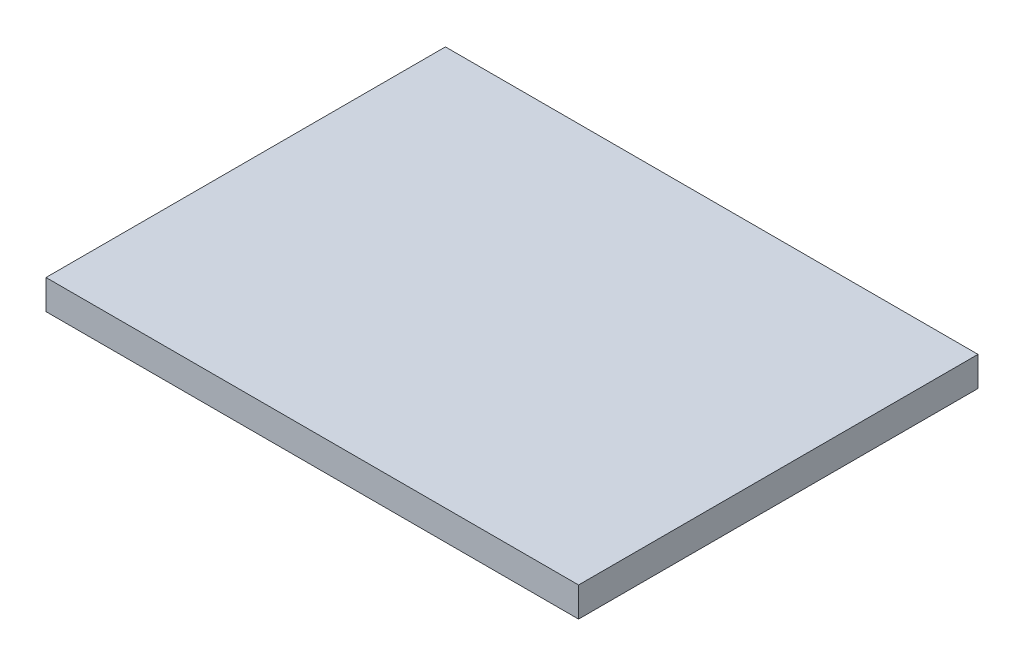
ISO-10303-21;
HEADER;
FILE_DESCRIPTION(('STEP AP214'),'2;1');
FILE_NAME('part.step','',(''),(''),'','','');
FILE_SCHEMA(('AUTOMOTIVE_DESIGN { 1 0 10303 214 1 1 1 1 }'));
ENDSEC;
DATA;
#1=APPLICATION_CONTEXT('core data for automotive mechanical design processes');
#2=APPLICATION_PROTOCOL_DEFINITION('international standard','automotive_design',2000,#1);
#3=PRODUCT_CONTEXT('',#1,'mechanical');
#4=PRODUCT('Part','Part','',(#3));
#5=PRODUCT_RELATED_PRODUCT_CATEGORY('part','',(#4));
#6=PRODUCT_DEFINITION_FORMATION('','',#4);
#7=PRODUCT_DEFINITION_CONTEXT('part definition',#1,'design');
#8=PRODUCT_DEFINITION('design','',#6,#7);
#9=PRODUCT_DEFINITION_SHAPE('','',#8);
#10=(LENGTH_UNIT() NAMED_UNIT(*) SI_UNIT(.MILLI.,.METRE.));
#11=(NAMED_UNIT(*) PLANE_ANGLE_UNIT() SI_UNIT($,.RADIAN.));
#12=(NAMED_UNIT(*) SI_UNIT($,.STERADIAN.) SOLID_ANGLE_UNIT());
#13=UNCERTAINTY_MEASURE_WITH_UNIT(LENGTH_MEASURE(1.E-05),#10,'distance_accuracy_value','');
#14=(GEOMETRIC_REPRESENTATION_CONTEXT(3) GLOBAL_UNCERTAINTY_ASSIGNED_CONTEXT((#13)) GLOBAL_UNIT_ASSIGNED_CONTEXT((#10,
#11,#12)) REPRESENTATION_CONTEXT('',''));
#15=CARTESIAN_POINT('',(0.,0.,0.));
#16=DIRECTION('',(0.,0.,1.));
#17=DIRECTION('',(1.,0.,0.));
#18=AXIS2_PLACEMENT_3D('',#15,#16,#17);
#19=CARTESIAN_POINT('',(-36.,-2.,0.));
#20=DIRECTION('',(0.,1.,0.));
#21=DIRECTION('',(0.,0.,1.));
#22=AXIS2_PLACEMENT_3D('',#19,#20,#21);
#23=PLANE('',#22);
#24=CARTESIAN_POINT('',(-5.5,-2.,21.5));
#25=DIRECTION('',(0.,-1.,0.));
#26=DIRECTION('',(-1.,0.,0.));
#27=AXIS2_PLACEMENT_3D('',#24,#25,#26);
#28=CIRCLE('',#27,2.5);
#29=CARTESIAN_POINT('',(-6.,-2.,19.0505102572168));
#30=VERTEX_POINT('',#29);
#31=CARTESIAN_POINT('',(-6.,-2.,23.9494897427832));
#32=VERTEX_POINT('',#31);
#33=EDGE_CURVE('E106',#30,#32,#28,.T.);
#34=ORIENTED_EDGE('',*,*,#33,.F.);
#35=DIRECTION('',(0.,0.,-1.));
#36=VECTOR('',#35,1.);
#37=CARTESIAN_POINT('',(-6.,-2.,23.9494897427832));
#38=LINE('',#37,#36);
#39=EDGE_CURVE('E47',#32,#30,#38,.T.);
#40=ORIENTED_EDGE('',*,*,#39,.F.);
#41=EDGE_LOOP('',(#34,#40));
#42=FACE_BOUND('',#41,.T.);
#43=DIRECTION('',(1.,0.,0.));
#44=VECTOR('',#43,1.);
#45=CARTESIAN_POINT('',(0.,-2.,0.));
#46=LINE('',#45,#44);
#47=CARTESIAN_POINT('',(-36.,-2.,0.));
#48=VERTEX_POINT('',#47);
#49=CARTESIAN_POINT('',(0.,-2.,0.));
#50=VERTEX_POINT('',#49);
#51=EDGE_CURVE('E133',#48,#50,#46,.T.);
#52=ORIENTED_EDGE('',*,*,#51,.T.);
#53=DIRECTION('',(0.,0.,1.));
#54=VECTOR('',#53,1.);
#55=CARTESIAN_POINT('',(0.,-2.,0.));
#56=LINE('',#55,#54);
#57=CARTESIAN_POINT('',(0.,-2.,27.));
#58=VERTEX_POINT('',#57);
#59=EDGE_CURVE('E136',#50,#58,#56,.T.);
#60=ORIENTED_EDGE('',*,*,#59,.T.);
#61=DIRECTION('',(-1.,0.,0.));
#62=VECTOR('',#61,1.);
#63=CARTESIAN_POINT('',(0.,-2.,27.));
#64=LINE('',#63,#62);
#65=CARTESIAN_POINT('',(-36.,-2.,27.));
#66=VERTEX_POINT('',#65);
#67=EDGE_CURVE('E138',#58,#66,#64,.T.);
#68=ORIENTED_EDGE('',*,*,#67,.T.);
#69=DIRECTION('',(0.,0.,-1.));
#70=VECTOR('',#69,1.);
#71=CARTESIAN_POINT('',(-36.,-2.,0.));
#72=LINE('',#71,#70);
#73=EDGE_CURVE('E140',#66,#48,#72,.T.);
#74=ORIENTED_EDGE('',*,*,#73,.T.);
#75=EDGE_LOOP('',(#52,#60,#68,#74));
#76=FACE_BOUND('',#75,.T.);
#77=CARTESIAN_POINT('',(-5.5,-2.,5.5));
#78=DIRECTION('',(0.,-1.,0.));
#79=DIRECTION('',(-1.,0.,0.));
#80=AXIS2_PLACEMENT_3D('',#77,#78,#79);
#81=CIRCLE('',#80,2.5);
#82=CARTESIAN_POINT('',(-6.,-2.,3.05051025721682));
#83=VERTEX_POINT('',#82);
#84=CARTESIAN_POINT('',(-6.,-2.,7.94948974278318));
#85=VERTEX_POINT('',#84);
#86=EDGE_CURVE('E89',#83,#85,#81,.T.);
#87=ORIENTED_EDGE('',*,*,#86,.F.);
#88=DIRECTION('',(0.,0.,-1.));
#89=VECTOR('',#88,1.);
#90=CARTESIAN_POINT('',(-6.,-2.,7.94948974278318));
#91=LINE('',#90,#89);
#92=EDGE_CURVE('E40',#85,#83,#91,.T.);
#93=ORIENTED_EDGE('',*,*,#92,.F.);
#94=EDGE_LOOP('',(#87,#93));
#95=FACE_BOUND('',#94,.T.);
#96=ADVANCED_FACE('F26',(#42,#76,#95),#23,.F.);
#97=CARTESIAN_POINT('',(0.,-2.,0.));
#98=DIRECTION('',(0.,0.,1.));
#99=DIRECTION('',(1.,0.,0.));
#100=AXIS2_PLACEMENT_3D('',#97,#98,#99);
#101=PLANE('',#100);
#102=DIRECTION('',(1.,0.,0.));
#103=VECTOR('',#102,1.);
#104=CARTESIAN_POINT('',(0.,0.,0.));
#105=LINE('',#104,#103);
#106=CARTESIAN_POINT('',(-36.,0.,0.));
#107=VERTEX_POINT('',#106);
#108=CARTESIAN_POINT('',(0.,0.,0.));
#109=VERTEX_POINT('',#108);
#110=EDGE_CURVE('E124',#107,#109,#105,.T.);
#111=ORIENTED_EDGE('',*,*,#110,.T.);
#112=DIRECTION('',(0.,1.,0.));
#113=VECTOR('',#112,1.);
#114=CARTESIAN_POINT('',(0.,-2.,0.));
#115=LINE('',#114,#113);
#116=EDGE_CURVE('E11',#50,#109,#115,.T.);
#117=ORIENTED_EDGE('',*,*,#116,.F.);
#118=ORIENTED_EDGE('',*,*,#51,.F.);
#119=DIRECTION('',(0.,1.,0.));
#120=VECTOR('',#119,1.);
#121=CARTESIAN_POINT('',(-36.,-2.,0.));
#122=LINE('',#121,#120);
#123=EDGE_CURVE('E142',#48,#107,#122,.T.);
#124=ORIENTED_EDGE('',*,*,#123,.T.);
#125=EDGE_LOOP('',(#111,#117,#118,#124));
#126=FACE_BOUND('',#125,.T.);
#127=ADVANCED_FACE('F28',(#126),#101,.F.);
#128=CARTESIAN_POINT('',(0.,-2.,0.));
#129=DIRECTION('',(-1.,0.,0.));
#130=DIRECTION('',(0.,0.,1.));
#131=AXIS2_PLACEMENT_3D('',#128,#129,#130);
#132=PLANE('',#131);
#133=DIRECTION('',(0.,0.,1.));
#134=VECTOR('',#133,1.);
#135=CARTESIAN_POINT('',(0.,0.,0.));
#136=LINE('',#135,#134);
#137=CARTESIAN_POINT('',(0.,0.,27.));
#138=VERTEX_POINT('',#137);
#139=EDGE_CURVE('E127',#109,#138,#136,.T.);
#140=ORIENTED_EDGE('',*,*,#139,.T.);
#141=DIRECTION('',(0.,1.,0.));
#142=VECTOR('',#141,1.);
#143=CARTESIAN_POINT('',(0.,-2.,27.));
#144=LINE('',#143,#142);
#145=EDGE_CURVE('E34',#58,#138,#144,.T.);
#146=ORIENTED_EDGE('',*,*,#145,.F.);
#147=ORIENTED_EDGE('',*,*,#59,.F.);
#148=ORIENTED_EDGE('',*,*,#116,.T.);
#149=EDGE_LOOP('',(#140,#146,#147,#148));
#150=FACE_BOUND('',#149,.T.);
#151=ADVANCED_FACE('F167',(#150),#132,.F.);
#152=CARTESIAN_POINT('',(0.,-2.,27.));
#153=DIRECTION('',(0.,0.,-1.));
#154=DIRECTION('',(-1.,0.,0.));
#155=AXIS2_PLACEMENT_3D('',#152,#153,#154);
#156=PLANE('',#155);
#157=DIRECTION('',(-1.,0.,0.));
#158=VECTOR('',#157,1.);
#159=CARTESIAN_POINT('',(0.,0.,27.));
#160=LINE('',#159,#158);
#161=CARTESIAN_POINT('',(-36.,0.,27.));
#162=VERTEX_POINT('',#161);
#163=EDGE_CURVE('E129',#138,#162,#160,.T.);
#164=ORIENTED_EDGE('',*,*,#163,.T.);
#165=DIRECTION('',(0.,1.,0.));
#166=VECTOR('',#165,1.);
#167=CARTESIAN_POINT('',(-36.,-2.,27.));
#168=LINE('',#167,#166);
#169=EDGE_CURVE('E145',#66,#162,#168,.T.);
#170=ORIENTED_EDGE('',*,*,#169,.F.);
#171=ORIENTED_EDGE('',*,*,#67,.F.);
#172=ORIENTED_EDGE('',*,*,#145,.T.);
#173=EDGE_LOOP('',(#164,#170,#171,#172));
#174=FACE_BOUND('',#173,.T.);
#175=ADVANCED_FACE('F152',(#174),#156,.F.);
#176=CARTESIAN_POINT('',(-36.,-2.,0.));
#177=DIRECTION('',(1.,0.,0.));
#178=DIRECTION('',(0.,0.,-1.));
#179=AXIS2_PLACEMENT_3D('',#176,#177,#178);
#180=PLANE('',#179);
#181=DIRECTION('',(0.,0.,-1.));
#182=VECTOR('',#181,1.);
#183=CARTESIAN_POINT('',(-36.,0.,0.));
#184=LINE('',#183,#182);
#185=EDGE_CURVE('E131',#162,#107,#184,.T.);
#186=ORIENTED_EDGE('',*,*,#185,.T.);
#187=ORIENTED_EDGE('',*,*,#123,.F.);
#188=ORIENTED_EDGE('',*,*,#73,.F.);
#189=ORIENTED_EDGE('',*,*,#169,.T.);
#190=EDGE_LOOP('',(#186,#187,#188,#189));
#191=FACE_BOUND('',#190,.T.);
#192=ADVANCED_FACE('F161',(#191),#180,.F.);
#193=CARTESIAN_POINT('',(-36.,0.,0.));
#194=DIRECTION('',(0.,1.,0.));
#195=DIRECTION('',(0.,0.,1.));
#196=AXIS2_PLACEMENT_3D('',#193,#194,#195);
#197=PLANE('',#196);
#198=ORIENTED_EDGE('',*,*,#110,.F.);
#199=ORIENTED_EDGE('',*,*,#185,.F.);
#200=ORIENTED_EDGE('',*,*,#163,.F.);
#201=ORIENTED_EDGE('',*,*,#139,.F.);
#202=EDGE_LOOP('',(#198,#199,#200,#201));
#203=FACE_BOUND('',#202,.T.);
#204=ADVANCED_FACE('F158',(#203),#197,.T.);
#205=CARTESIAN_POINT('',(-5.5,-5.,21.5));
#206=DIRECTION('',(0.,1.,0.));
#207=DIRECTION('',(-1.,0.,0.));
#208=AXIS2_PLACEMENT_3D('',#205,#206,#207);
#209=CYLINDRICAL_SURFACE('',#208,2.5);
#210=ORIENTED_EDGE('',*,*,#33,.T.);
#211=DIRECTION('',(0.,1.,0.));
#212=VECTOR('',#211,1.);
#213=CARTESIAN_POINT('',(-6.,-5.,23.9494897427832));
#214=LINE('',#213,#212);
#215=CARTESIAN_POINT('',(-6.,-5.,23.9494897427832));
#216=VERTEX_POINT('',#215);
#217=EDGE_CURVE('E122',#216,#32,#214,.T.);
#218=ORIENTED_EDGE('',*,*,#217,.F.);
#219=CARTESIAN_POINT('',(-5.5,-5.,21.5));
#220=DIRECTION('',(0.,-1.,0.));
#221=DIRECTION('',(-1.,0.,0.));
#222=AXIS2_PLACEMENT_3D('',#219,#220,#221);
#223=CIRCLE('',#222,2.5);
#224=CARTESIAN_POINT('',(-6.,-5.,19.0505102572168));
#225=VERTEX_POINT('',#224);
#226=EDGE_CURVE('E114',#225,#216,#223,.T.);
#227=ORIENTED_EDGE('',*,*,#226,.F.);
#228=DIRECTION('',(0.,1.,0.));
#229=VECTOR('',#228,1.);
#230=CARTESIAN_POINT('',(-6.,-5.,19.0505102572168));
#231=LINE('',#230,#229);
#232=EDGE_CURVE('E119',#225,#30,#231,.T.);
#233=ORIENTED_EDGE('',*,*,#232,.T.);
#234=EDGE_LOOP('',(#210,#218,#227,#233));
#235=FACE_BOUND('',#234,.T.);
#236=ADVANCED_FACE('F186',(#235),#209,.T.);
#237=CARTESIAN_POINT('',(-6.,-5.,23.9494897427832));
#238=DIRECTION('',(1.,0.,0.));
#239=DIRECTION('',(0.,1.,0.));
#240=AXIS2_PLACEMENT_3D('',#237,#238,#239);
#241=PLANE('',#240);
#242=ORIENTED_EDGE('',*,*,#39,.T.);
#243=ORIENTED_EDGE('',*,*,#232,.F.);
#244=DIRECTION('',(0.,0.,-1.));
#245=VECTOR('',#244,1.);
#246=CARTESIAN_POINT('',(-6.,-5.,23.9494897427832));
#247=LINE('',#246,#245);
#248=EDGE_CURVE('E117',#216,#225,#247,.T.);
#249=ORIENTED_EDGE('',*,*,#248,.F.);
#250=ORIENTED_EDGE('',*,*,#217,.T.);
#251=EDGE_LOOP('',(#242,#243,#249,#250));
#252=FACE_BOUND('',#251,.T.);
#253=ADVANCED_FACE('F189',(#252),#241,.F.);
#254=CARTESIAN_POINT('',(-5.5,-5.,21.5));
#255=DIRECTION('',(0.,1.,0.));
#256=DIRECTION('',(-1.,0.,0.));
#257=AXIS2_PLACEMENT_3D('',#254,#255,#256);
#258=PLANE('',#257);
#259=ORIENTED_EDGE('',*,*,#226,.T.);
#260=ORIENTED_EDGE('',*,*,#248,.T.);
#261=EDGE_LOOP('',(#259,#260));
#262=FACE_BOUND('',#261,.T.);
#263=ADVANCED_FACE('F194',(#262),#258,.F.);
#264=CARTESIAN_POINT('',(-5.5,-5.,5.5));
#265=DIRECTION('',(0.,1.,0.));
#266=DIRECTION('',(-1.,0.,0.));
#267=AXIS2_PLACEMENT_3D('',#264,#265,#266);
#268=CYLINDRICAL_SURFACE('',#267,2.5);
#269=ORIENTED_EDGE('',*,*,#86,.T.);
#270=DIRECTION('',(0.,1.,0.));
#271=VECTOR('',#270,1.);
#272=CARTESIAN_POINT('',(-6.,-5.,7.94948974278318));
#273=LINE('',#272,#271);
#274=CARTESIAN_POINT('',(-6.,-5.,7.94948974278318));
#275=VERTEX_POINT('',#274);
#276=EDGE_CURVE('E99',#275,#85,#273,.T.);
#277=ORIENTED_EDGE('',*,*,#276,.F.);
#278=CARTESIAN_POINT('',(-5.5,-5.,5.5));
#279=DIRECTION('',(0.,-1.,0.));
#280=DIRECTION('',(-1.,0.,0.));
#281=AXIS2_PLACEMENT_3D('',#278,#279,#280);
#282=CIRCLE('',#281,2.5);
#283=CARTESIAN_POINT('',(-6.,-5.,3.05051025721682));
#284=VERTEX_POINT('',#283);
#285=EDGE_CURVE('E100',#284,#275,#282,.T.);
#286=ORIENTED_EDGE('',*,*,#285,.F.);
#287=DIRECTION('',(0.,1.,0.));
#288=VECTOR('',#287,1.);
#289=CARTESIAN_POINT('',(-6.,-5.,3.05051025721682));
#290=LINE('',#289,#288);
#291=EDGE_CURVE('E97',#284,#83,#290,.T.);
#292=ORIENTED_EDGE('',*,*,#291,.T.);
#293=EDGE_LOOP('',(#269,#277,#286,#292));
#294=FACE_BOUND('',#293,.T.);
#295=ADVANCED_FACE('F102',(#294),#268,.T.);
#296=CARTESIAN_POINT('',(-6.,-5.,7.94948974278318));
#297=DIRECTION('',(1.,0.,0.));
#298=DIRECTION('',(0.,1.,0.));
#299=AXIS2_PLACEMENT_3D('',#296,#297,#298);
#300=PLANE('',#299);
#301=ORIENTED_EDGE('',*,*,#92,.T.);
#302=ORIENTED_EDGE('',*,*,#291,.F.);
#303=DIRECTION('',(0.,0.,-1.));
#304=VECTOR('',#303,1.);
#305=CARTESIAN_POINT('',(-6.,-5.,7.94948974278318));
#306=LINE('',#305,#304);
#307=EDGE_CURVE('E104',#275,#284,#306,.T.);
#308=ORIENTED_EDGE('',*,*,#307,.F.);
#309=ORIENTED_EDGE('',*,*,#276,.T.);
#310=EDGE_LOOP('',(#301,#302,#308,#309));
#311=FACE_BOUND('',#310,.T.);
#312=ADVANCED_FACE('F96',(#311),#300,.F.);
#313=CARTESIAN_POINT('',(-5.5,-5.,5.5));
#314=DIRECTION('',(0.,1.,0.));
#315=DIRECTION('',(-1.,0.,0.));
#316=AXIS2_PLACEMENT_3D('',#313,#314,#315);
#317=PLANE('',#316);
#318=ORIENTED_EDGE('',*,*,#285,.T.);
#319=ORIENTED_EDGE('',*,*,#307,.T.);
#320=EDGE_LOOP('',(#318,#319));
#321=FACE_BOUND('',#320,.T.);
#322=ADVANCED_FACE('F205',(#321),#317,.F.);
#323=CLOSED_SHELL('',(#96,#127,#151,#175,#192,#204,#236,#253,#263,#295,#312,#322));
#324=MANIFOLD_SOLID_BREP('B2',#323);
#325=ADVANCED_BREP_SHAPE_REPRESENTATION('',(#18,#324),#14);
#326=SHAPE_DEFINITION_REPRESENTATION(#9,#325);
ENDSEC;
END-ISO-10303-21;
